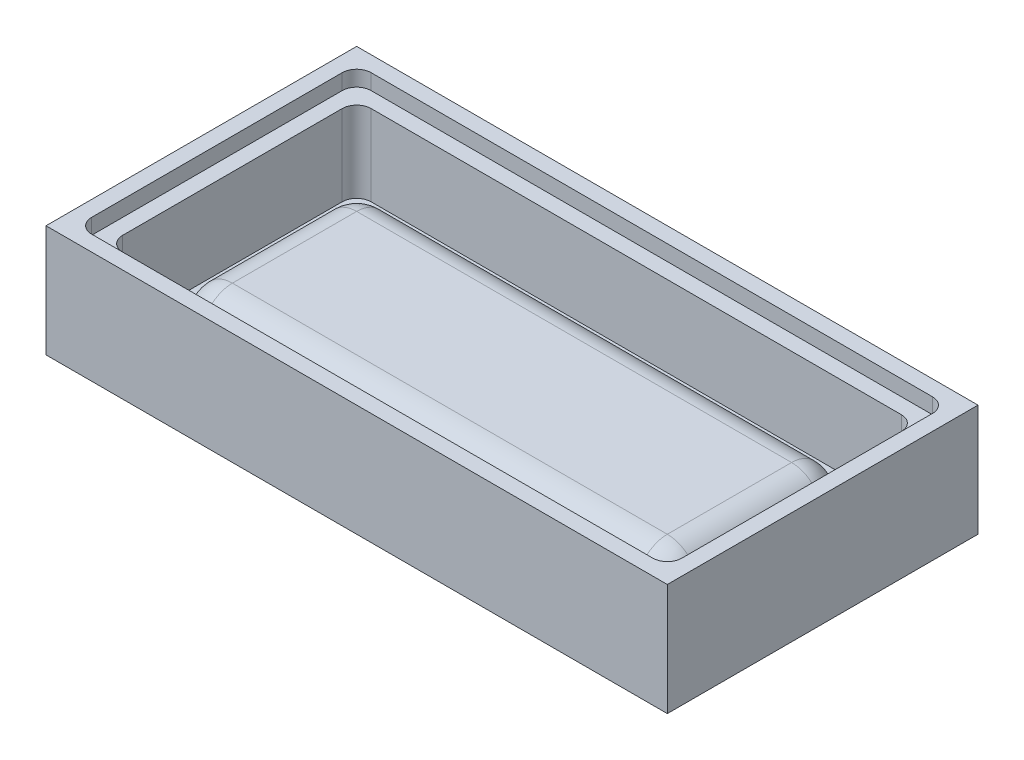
from build123d import *

# Parameters (mm, degrees)
SKETCH1_W           = 200
SKETCH1_H           = 100
BOSS_EXTRUDE1_DEPTH = 36
CUT_EXTRUDE1_DEPTH  = 5
CUT_EXTRUDE2_DEPTH  = 26
SKETCH4_W           = 160
SKETCH4_H           = 60
BOSS_EXTRUDE2_DEPTH = 15
FILLET1_R           = 10


with BuildPart() as part:
    # Sketch1 → Boss-Extrude1 (new body)
    with BuildSketch(Plane(origin=(0, 0, 0), x_dir=(1, 0, 0), z_dir=(0, 1, 0))):
        Rectangle(SKETCH1_W, SKETCH1_H)
    extrude(amount=BOSS_EXTRUDE1_DEPTH)

    # Sketch2 → Cut-Extrude1 (cut)
    with BuildSketch(Plane(origin=(0, 36, 0), x_dir=(1, 0, 0), z_dir=(0, 1, 0))):
        with BuildLine():
            Line((-90.335774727, 45), (90.335774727, 45))
            ThreePointArc((90.335774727, 45), (93.633880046, 43.633880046), (95, 40.335774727))
            Line((95, 40.335774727), (95, -40.335774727))
            ThreePointArc((95, -40.335774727), (93.633880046, -43.633880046), (90.335774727, -45))
            Line((90.335774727, -45), (-90.335774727, -45))
            ThreePointArc((-90.335774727, -45), (-93.633880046, -43.633880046), (-95, -40.335774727))
            Line((-95, -40.335774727), (-95, 40.335774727))
            ThreePointArc((-95, 40.335774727), (-93.633880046, 43.633880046), (-90.335774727, 45))
        make_face()
    extrude(amount=-CUT_EXTRUDE1_DEPTH, mode=Mode.SUBTRACT)

    # Sketch3 → Cut-Extrude2 (cut)
    with BuildSketch(Plane(origin=(0, 31, 0), x_dir=(1, 0, 0), z_dir=(0, 1, 0))):
        with BuildLine():
            Line((90, -35.335774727), (90, 35.335774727))
            ThreePointArc((90, 35.335774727), (88.633880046, 38.633880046), (85.335774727, 40))
            Line((85.335774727, 40), (-85.335774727, 40))
            ThreePointArc((-85.335774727, 40), (-88.633880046, 38.633880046), (-90, 35.335774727))
            Line((-90, 35.335774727), (-90, -35.335774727))
            ThreePointArc((-90, -35.335774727), (-88.633880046, -38.633880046), (-85.335774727, -40))
            Line((-85.335774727, -40), (85.335774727, -40))
            ThreePointArc((85.335774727, -40), (88.633880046, -38.633880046), (90, -35.335774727))
        make_face()
    extrude(amount=-CUT_EXTRUDE2_DEPTH, mode=Mode.SUBTRACT)

    # Sketch4 → Boss-Extrude2 (add)
    with BuildSketch(Plane(origin=(0, 5, 0), x_dir=(1, 0, 0), z_dir=(0, 1, 0))):
        Rectangle(SKETCH4_W, SKETCH4_H)
    extrude(amount=BOSS_EXTRUDE2_DEPTH)

    # Fillet1
    fillet1_edges = [part.edges().sort_by_distance(p)[0] for p in [
        (-80, 12.5, -30),
        (-80, 12.5, 30),
        (80, 12.5, 30),
        (80, 12.5, -30),
        (-80, 20, 0),
        (0, 20, 30),
        (80, 20, 0),
        (0, 20, -30),
    ]]
    fillet(fillet1_edges, radius=FILLET1_R)


solid = part.part
